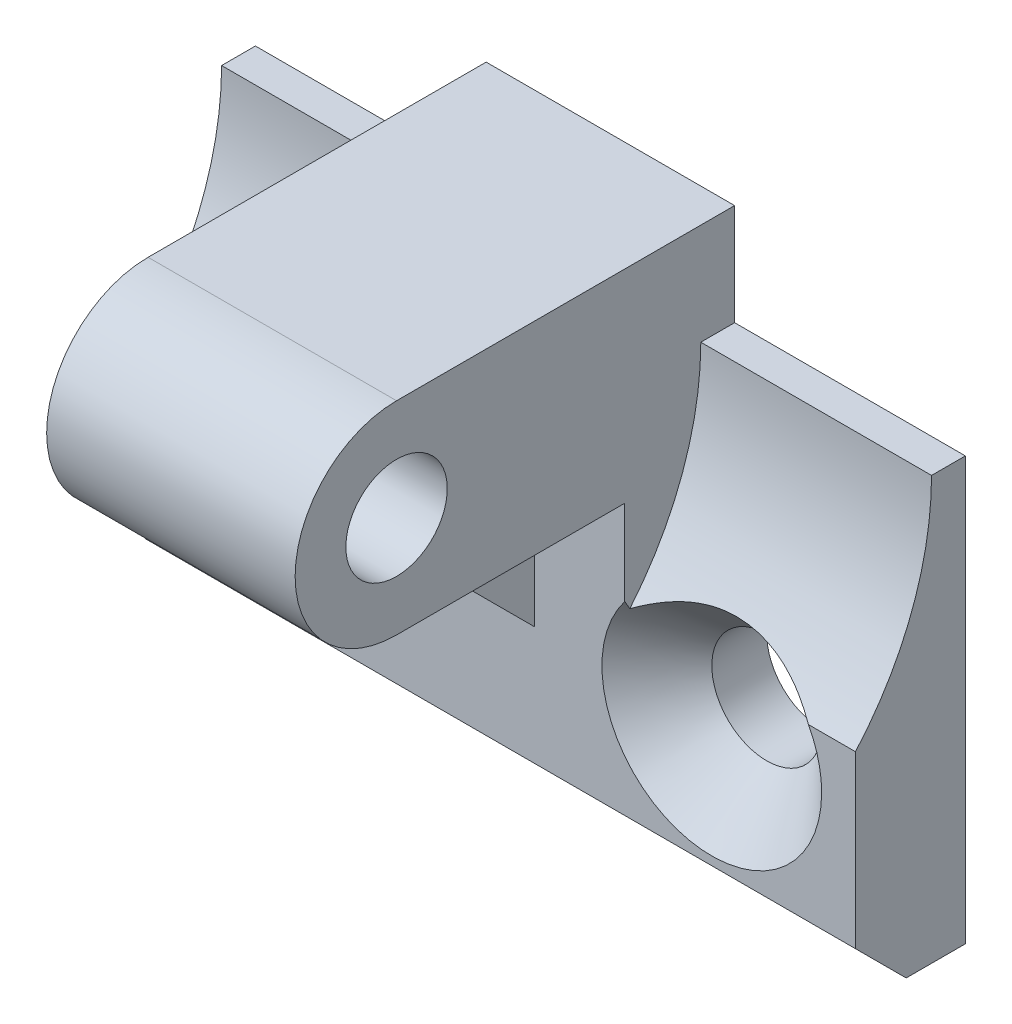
ISO-10303-21;
HEADER;
FILE_DESCRIPTION(('STEP AP214'),'2;1');
FILE_NAME('part.step','',(''),(''),'','','');
FILE_SCHEMA(('AUTOMOTIVE_DESIGN { 1 0 10303 214 1 1 1 1 }'));
ENDSEC;
DATA;
#1=APPLICATION_CONTEXT('core data for automotive mechanical design processes');
#2=APPLICATION_PROTOCOL_DEFINITION('international standard','automotive_design',2000,#1);
#3=PRODUCT_CONTEXT('',#1,'mechanical');
#4=PRODUCT('Part','Part','',(#3));
#5=PRODUCT_RELATED_PRODUCT_CATEGORY('part','',(#4));
#6=PRODUCT_DEFINITION_FORMATION('','',#4);
#7=PRODUCT_DEFINITION_CONTEXT('part definition',#1,'design');
#8=PRODUCT_DEFINITION('design','',#6,#7);
#9=PRODUCT_DEFINITION_SHAPE('','',#8);
#10=(LENGTH_UNIT() NAMED_UNIT(*) SI_UNIT(.MILLI.,.METRE.));
#11=(NAMED_UNIT(*) PLANE_ANGLE_UNIT() SI_UNIT($,.RADIAN.));
#12=(NAMED_UNIT(*) SI_UNIT($,.STERADIAN.) SOLID_ANGLE_UNIT());
#13=UNCERTAINTY_MEASURE_WITH_UNIT(LENGTH_MEASURE(1.E-05),#10,'distance_accuracy_value','');
#14=(GEOMETRIC_REPRESENTATION_CONTEXT(3) GLOBAL_UNCERTAINTY_ASSIGNED_CONTEXT((#13)) GLOBAL_UNIT_ASSIGNED_CONTEXT((#10,
#11,#12)) REPRESENTATION_CONTEXT('',''));
#15=CARTESIAN_POINT('',(0.,0.,0.));
#16=DIRECTION('',(0.,0.,1.));
#17=DIRECTION('',(1.,0.,0.));
#18=AXIS2_PLACEMENT_3D('',#15,#16,#17);
#19=CARTESIAN_POINT('',(-8.5,-7.,6.5));
#20=DIRECTION('',(0.,0.,-1.));
#21=DIRECTION('',(0.,-1.,0.));
#22=AXIS2_PLACEMENT_3D('',#19,#20,#21);
#23=PLANE('',#22);
#24=CARTESIAN_POINT('',(0.,0.,6.5));
#25=DIRECTION('',(0.,0.,1.));
#26=DIRECTION('',(1.,0.,0.));
#27=AXIS2_PLACEMENT_3D('',#24,#25,#26);
#28=CIRCLE('',#27,6.5);
#29=CARTESIAN_POINT('',(-5.7163298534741,3.09411910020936,6.5));
#30=VERTEX_POINT('',#29);
#31=CARTESIAN_POINT('',(5.15,3.96579121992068,6.5));
#32=VERTEX_POINT('',#31);
#33=EDGE_CURVE('E30',#30,#32,#28,.T.);
#34=ORIENTED_EDGE('',*,*,#33,.F.);
#35=DIRECTION('',(-1.,0.,0.));
#36=VECTOR('',#35,1.);
#37=CARTESIAN_POINT('',(5.15,3.09411910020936,6.5));
#38=LINE('',#37,#36);
#39=CARTESIAN_POINT('',(-8.5,3.09411910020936,6.5));
#40=VERTEX_POINT('',#39);
#41=EDGE_CURVE('E148',#30,#40,#38,.T.);
#42=ORIENTED_EDGE('',*,*,#41,.T.);
#43=DIRECTION('',(0.,1.,0.));
#44=VECTOR('',#43,1.);
#45=CARTESIAN_POINT('',(-8.5,-7.,6.5));
#46=LINE('',#45,#44);
#47=CARTESIAN_POINT('',(-8.5,-7.,6.5));
#48=VERTEX_POINT('',#47);
#49=EDGE_CURVE('E229',#48,#40,#46,.T.);
#50=ORIENTED_EDGE('',*,*,#49,.F.);
#51=DIRECTION('',(1.,0.,0.));
#52=VECTOR('',#51,1.);
#53=CARTESIAN_POINT('',(-8.5,-7.,6.5));
#54=LINE('',#53,#52);
#55=CARTESIAN_POINT('',(33.5,-7.,6.5));
#56=VERTEX_POINT('',#55);
#57=EDGE_CURVE('E251',#48,#56,#54,.T.);
#58=ORIENTED_EDGE('',*,*,#57,.T.);
#59=DIRECTION('',(0.,1.,0.));
#60=VECTOR('',#59,1.);
#61=CARTESIAN_POINT('',(33.5,-7.,6.5));
#62=LINE('',#61,#60);
#63=CARTESIAN_POINT('',(33.5,3.09411910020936,6.5));
#64=VERTEX_POINT('',#63);
#65=EDGE_CURVE('E219',#56,#64,#62,.T.);
#66=ORIENTED_EDGE('',*,*,#65,.T.);
#67=DIRECTION('',(1.,0.,0.));
#68=VECTOR('',#67,1.);
#69=CARTESIAN_POINT('',(19.85,3.09411910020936,6.5));
#70=LINE('',#69,#68);
#71=CARTESIAN_POINT('',(30.7163298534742,3.09411910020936,6.5));
#72=VERTEX_POINT('',#71);
#73=EDGE_CURVE('E553',#64,#72,#70,.F.);
#74=ORIENTED_EDGE('',*,*,#73,.T.);
#75=CARTESIAN_POINT('',(25.,0.,6.5));
#76=DIRECTION('',(0.,0.,1.));
#77=DIRECTION('',(1.,0.,0.));
#78=AXIS2_PLACEMENT_3D('',#75,#76,#77);
#79=CIRCLE('',#78,6.5);
#80=CARTESIAN_POINT('',(19.85,3.96579121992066,6.5));
#81=VERTEX_POINT('',#80);
#82=EDGE_CURVE('E321',#81,#72,#79,.T.);
#83=ORIENTED_EDGE('',*,*,#82,.F.);
#84=DIRECTION('',(0.,1.,0.));
#85=VECTOR('',#84,1.);
#86=CARTESIAN_POINT('',(19.85,15.,6.5));
#87=LINE('',#86,#85);
#88=CARTESIAN_POINT('',(19.85,9.,6.5));
#89=VERTEX_POINT('',#88);
#90=EDGE_CURVE('E256',#81,#89,#87,.T.);
#91=ORIENTED_EDGE('',*,*,#90,.T.);
#92=DIRECTION('',(1.,0.,0.));
#93=VECTOR('',#92,1.);
#94=CARTESIAN_POINT('',(14.5,9.,6.5));
#95=LINE('',#94,#93);
#96=CARTESIAN_POINT('',(14.5,9.,6.5));
#97=VERTEX_POINT('',#96);
#98=EDGE_CURVE('E550',#97,#89,#95,.T.);
#99=ORIENTED_EDGE('',*,*,#98,.F.);
#100=DIRECTION('',(0.,1.,0.));
#101=VECTOR('',#100,1.);
#102=CARTESIAN_POINT('',(14.5,0.,6.5));
#103=LINE('',#102,#101);
#104=CARTESIAN_POINT('',(14.5,0.,6.5));
#105=VERTEX_POINT('',#104);
#106=EDGE_CURVE('E542',#105,#97,#103,.T.);
#107=ORIENTED_EDGE('',*,*,#106,.F.);
#108=DIRECTION('',(1.,0.,0.));
#109=VECTOR('',#108,1.);
#110=CARTESIAN_POINT('',(-8.5,0.,6.5));
#111=LINE('',#110,#109);
#112=CARTESIAN_POINT('',(10.5,0.,6.5));
#113=VERTEX_POINT('',#112);
#114=EDGE_CURVE('E248',#113,#105,#111,.T.);
#115=ORIENTED_EDGE('',*,*,#114,.F.);
#116=DIRECTION('',(0.,1.,0.));
#117=VECTOR('',#116,1.);
#118=CARTESIAN_POINT('',(10.5,0.,6.5));
#119=LINE('',#118,#117);
#120=CARTESIAN_POINT('',(10.5,9.,6.5));
#121=VERTEX_POINT('',#120);
#122=EDGE_CURVE('E163',#113,#121,#119,.T.);
#123=ORIENTED_EDGE('',*,*,#122,.T.);
#124=DIRECTION('',(-1.,0.,0.));
#125=VECTOR('',#124,1.);
#126=CARTESIAN_POINT('',(10.5,9.,6.5));
#127=LINE('',#126,#125);
#128=CARTESIAN_POINT('',(5.15,9.,6.5));
#129=VERTEX_POINT('',#128);
#130=EDGE_CURVE('E158',#121,#129,#127,.T.);
#131=ORIENTED_EDGE('',*,*,#130,.T.);
#132=DIRECTION('',(0.,1.,0.));
#133=VECTOR('',#132,1.);
#134=CARTESIAN_POINT('',(5.15,15.,6.5));
#135=LINE('',#134,#133);
#136=EDGE_CURVE('E151',#32,#129,#135,.T.);
#137=ORIENTED_EDGE('',*,*,#136,.F.);
#138=EDGE_LOOP('',(#34,#42,#50,#58,#66,#74,#83,#91,#99,#107,#115,#123,#131,#137));
#139=FACE_BOUND('',#138,.T.);
#140=ADVANCED_FACE('F14',(#139),#23,.F.);
#141=CARTESIAN_POINT('',(-8.5,21.,0.));
#142=DIRECTION('',(0.,0.,1.));
#143=DIRECTION('',(0.,1.,0.));
#144=AXIS2_PLACEMENT_3D('',#141,#142,#143);
#145=PLANE('',#144);
#146=CARTESIAN_POINT('',(25.,0.,0.));
#147=DIRECTION('',(0.,0.,1.));
#148=DIRECTION('',(0.,1.,0.));
#149=AXIS2_PLACEMENT_3D('',#146,#147,#148);
#150=CIRCLE('',#149,3.25);
#151=CARTESIAN_POINT('',(25.,3.25,0.));
#152=VERTEX_POINT('',#151);
#153=EDGE_CURVE('E265',#152,#152,#150,.F.);
#154=ORIENTED_EDGE('',*,*,#153,.F.);
#155=EDGE_LOOP('',(#154));
#156=FACE_BOUND('',#155,.T.);
#157=DIRECTION('',(1.,0.,0.));
#158=VECTOR('',#157,1.);
#159=CARTESIAN_POINT('',(19.85,15.,0.));
#160=LINE('',#159,#158);
#161=CARTESIAN_POINT('',(19.85,15.,0.));
#162=VERTEX_POINT('',#161);
#163=CARTESIAN_POINT('',(33.5,15.,0.));
#164=VERTEX_POINT('',#163);
#165=EDGE_CURVE('E188',#162,#164,#160,.T.);
#166=ORIENTED_EDGE('',*,*,#165,.T.);
#167=DIRECTION('',(0.,-1.,0.));
#168=VECTOR('',#167,1.);
#169=CARTESIAN_POINT('',(33.5,21.,0.));
#170=LINE('',#169,#168);
#171=CARTESIAN_POINT('',(33.5,-10.,0.));
#172=VERTEX_POINT('',#171);
#173=EDGE_CURVE('E221',#164,#172,#170,.T.);
#174=ORIENTED_EDGE('',*,*,#173,.T.);
#175=DIRECTION('',(1.,0.,0.));
#176=VECTOR('',#175,1.);
#177=CARTESIAN_POINT('',(-8.5,-10.,0.));
#178=LINE('',#177,#176);
#179=CARTESIAN_POINT('',(-8.5,-10.,0.));
#180=VERTEX_POINT('',#179);
#181=EDGE_CURVE('E233',#180,#172,#178,.T.);
#182=ORIENTED_EDGE('',*,*,#181,.F.);
#183=DIRECTION('',(0.,-1.,0.));
#184=VECTOR('',#183,1.);
#185=CARTESIAN_POINT('',(-8.5,21.,0.));
#186=LINE('',#185,#184);
#187=CARTESIAN_POINT('',(-8.5,15.,0.));
#188=VERTEX_POINT('',#187);
#189=EDGE_CURVE('E231',#188,#180,#186,.T.);
#190=ORIENTED_EDGE('',*,*,#189,.F.);
#191=DIRECTION('',(-1.,0.,0.));
#192=VECTOR('',#191,1.);
#193=CARTESIAN_POINT('',(5.15,15.,0.));
#194=LINE('',#193,#192);
#195=CARTESIAN_POINT('',(5.15,15.,0.));
#196=VERTEX_POINT('',#195);
#197=EDGE_CURVE('E209',#196,#188,#194,.T.);
#198=ORIENTED_EDGE('',*,*,#197,.F.);
#199=DIRECTION('',(0.,-1.,0.));
#200=VECTOR('',#199,1.);
#201=CARTESIAN_POINT('',(5.15,21.,0.));
#202=LINE('',#201,#200);
#203=CARTESIAN_POINT('',(5.15,21.,0.));
#204=VERTEX_POINT('',#203);
#205=EDGE_CURVE('E202',#204,#196,#202,.T.);
#206=ORIENTED_EDGE('',*,*,#205,.F.);
#207=DIRECTION('',(1.,0.,0.));
#208=VECTOR('',#207,1.);
#209=CARTESIAN_POINT('',(-8.5,21.,0.));
#210=LINE('',#209,#208);
#211=CARTESIAN_POINT('',(19.85,21.,0.));
#212=VERTEX_POINT('',#211);
#213=EDGE_CURVE('E236',#204,#212,#210,.T.);
#214=ORIENTED_EDGE('',*,*,#213,.T.);
#215=DIRECTION('',(0.,-1.,0.));
#216=VECTOR('',#215,1.);
#217=CARTESIAN_POINT('',(19.85,21.,0.));
#218=LINE('',#217,#216);
#219=EDGE_CURVE('E178',#212,#162,#218,.T.);
#220=ORIENTED_EDGE('',*,*,#219,.T.);
#221=EDGE_LOOP('',(#166,#174,#182,#190,#198,#206,#214,#220));
#222=FACE_BOUND('',#221,.T.);
#223=CARTESIAN_POINT('',(0.,0.,0.));
#224=DIRECTION('',(0.,0.,1.));
#225=DIRECTION('',(0.,1.,0.));
#226=AXIS2_PLACEMENT_3D('',#223,#224,#225);
#227=CIRCLE('',#226,3.25);
#228=CARTESIAN_POINT('',(0.,3.25,0.));
#229=VERTEX_POINT('',#228);
#230=EDGE_CURVE('E18',#229,#229,#227,.F.);
#231=ORIENTED_EDGE('',*,*,#230,.F.);
#232=EDGE_LOOP('',(#231));
#233=FACE_BOUND('',#232,.T.);
#234=ADVANCED_FACE('F325',(#156,#222,#233),#145,.F.);
#235=CARTESIAN_POINT('',(5.15,15.,20.));
#236=DIRECTION('',(-1.,0.,0.));
#237=DIRECTION('',(0.,1.,0.));
#238=AXIS2_PLACEMENT_3D('',#235,#236,#237);
#239=CYLINDRICAL_SURFACE('',#238,18.);
#240=CARTESIAN_POINT('',(5.1502,3.44665389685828,6.1970947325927));
#241=CARTESIAN_POINT('',(5.03097353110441,3.51777116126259,6.13756417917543));
#242=CARTESIAN_POINT('',(4.91015867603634,3.58778049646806,6.07990387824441));
#243=CARTESIAN_POINT('',(4.66514255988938,3.72504671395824,5.96849168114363));
#244=CARTESIAN_POINT('',(4.54094002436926,3.7923025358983,5.91474128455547));
#245=CARTESIAN_POINT('',(4.16218516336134,3.98951678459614,5.75930817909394));
#246=CARTESIAN_POINT('',(3.90232528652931,4.11441164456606,5.66386680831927));
#247=CARTESIAN_POINT('',(3.36648035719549,4.3464540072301,5.49058425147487));
#248=CARTESIAN_POINT('',(3.09038662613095,4.45345757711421,5.4128841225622));
#249=CARTESIAN_POINT('',(2.52556654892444,4.643122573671,5.27761164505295));
#250=CARTESIAN_POINT('',(2.23686344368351,4.72582677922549,5.22000389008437));
#251=CARTESIAN_POINT('',(1.75028461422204,4.83901207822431,5.14209759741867));
#252=CARTESIAN_POINT('',(1.55523637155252,4.87767497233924,5.11577981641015));
#253=CARTESIAN_POINT('',(1.16188178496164,4.94160789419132,5.07250007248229));
#254=CARTESIAN_POINT('',(0.963575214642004,4.96687698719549,5.05553876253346));
#255=CARTESIAN_POINT('',(0.566297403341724,5.00319093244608,5.03122301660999));
#256=CARTESIAN_POINT('',(0.367337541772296,5.01432136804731,5.02381077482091));
#257=CARTESIAN_POINT('',(-0.0309901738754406,5.0223294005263,5.01847423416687));
#258=CARTESIAN_POINT('',(-0.230358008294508,5.01920766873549,5.02054948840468));
#259=CARTESIAN_POINT('',(-0.62791601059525,4.99880655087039,5.03416299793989));
#260=CARTESIAN_POINT('',(-0.826106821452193,4.98153578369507,5.04569549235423));
#261=CARTESIAN_POINT('',(-1.22004437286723,4.93333026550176,5.07810337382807));
#262=CARTESIAN_POINT('',(-1.41579098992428,4.90239482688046,5.09897923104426));
#263=CARTESIAN_POINT('',(-1.8048426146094,4.82745155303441,5.1500397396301));
#264=CARTESIAN_POINT('',(-1.99812389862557,4.78336111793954,5.18028325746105));
#265=CARTESIAN_POINT('',(-2.37989730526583,4.68333538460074,5.24974130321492));
#266=CARTESIAN_POINT('',(-2.56838974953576,4.62740088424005,5.28895522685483));
#267=CARTESIAN_POINT('',(-3.0280125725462,4.47596339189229,5.39668181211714));
#268=CARTESIAN_POINT('',(-3.29593594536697,4.37427595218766,5.47026937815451));
#269=CARTESIAN_POINT('',(-3.81877841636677,4.15261287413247,5.63499932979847));
#270=CARTESIAN_POINT('',(-4.07367855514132,4.03261153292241,5.72616643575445));
#271=CARTESIAN_POINT('',(-4.56715960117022,3.78066854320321,5.92335802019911));
#272=CARTESIAN_POINT('',(-4.80589879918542,3.64888624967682,6.0291924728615));
#273=CARTESIAN_POINT('',(-5.1544578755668,3.44477329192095,6.19838625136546));
#274=CARTESIAN_POINT('',(-5.26888719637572,3.37577127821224,6.25642916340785));
#275=CARTESIAN_POINT('',(-5.49486466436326,3.23603571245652,6.37584481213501));
#276=CARTESIAN_POINT('',(-5.60641362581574,3.16530266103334,6.43721659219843));
#277=CARTESIAN_POINT('',(-5.71663866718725,3.09391910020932,6.50017638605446));
#278=B_SPLINE_CURVE_WITH_KNOTS('',3,(#240,#241,#242,#243,#244,#245,#246,#247,#248,#249,#250,
#251,#252,#253,#254,#255,#256,#257,#258,#259,#260,#261,#262,#263,#264,#265,#266,#267,#268,#269,
#270,#271,#272,#273,#274,#275,#276,#277),.UNSPECIFIED.,.F.,.F.,(4,2,2,2,2,2,2,2,2,2,2,2,2,2,2,2,
2,2,4),(0.,0.453109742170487,0.906392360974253,1.8161579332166,2.73292283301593,
3.64806396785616,4.24917824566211,4.85033446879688,5.44783419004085,6.04530576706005,
6.64241366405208,7.23955161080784,7.8405208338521,8.44144958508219,9.32739150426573,
10.2145884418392,11.0912114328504,11.52820679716,11.9650772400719),.UNSPECIFIED.);
#279=CARTESIAN_POINT('',(5.15,3.44677319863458,6.19699487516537));
#280=VERTEX_POINT('',#279);
#281=EDGE_CURVE('E137',#280,#30,#278,.T.);
#282=ORIENTED_EDGE('',*,*,#281,.F.);
#283=CARTESIAN_POINT('',(5.15,15.,20.));
#284=DIRECTION('',(-1.,0.,0.));
#285=DIRECTION('',(0.,1.,0.));
#286=AXIS2_PLACEMENT_3D('',#283,#284,#285);
#287=CIRCLE('',#286,18.);
#288=CARTESIAN_POINT('',(5.15,15.,2.));
#289=VERTEX_POINT('',#288);
#290=EDGE_CURVE('E207',#289,#280,#287,.T.);
#291=ORIENTED_EDGE('',*,*,#290,.F.);
#292=DIRECTION('',(-1.,0.,0.));
#293=VECTOR('',#292,1.);
#294=CARTESIAN_POINT('',(5.15,15.,2.));
#295=LINE('',#294,#293);
#296=CARTESIAN_POINT('',(-8.5,15.,2.));
#297=VERTEX_POINT('',#296);
#298=EDGE_CURVE('E211',#289,#297,#295,.T.);
#299=ORIENTED_EDGE('',*,*,#298,.T.);
#300=CARTESIAN_POINT('',(-8.5,15.,20.));
#301=DIRECTION('',(-1.,0.,0.));
#302=DIRECTION('',(0.,1.,0.));
#303=AXIS2_PLACEMENT_3D('',#300,#301,#302);
#304=CIRCLE('',#303,18.);
#305=EDGE_CURVE('E156',#297,#40,#304,.T.);
#306=ORIENTED_EDGE('',*,*,#305,.T.);
#307=ORIENTED_EDGE('',*,*,#41,.F.);
#308=EDGE_LOOP('',(#282,#291,#299,#306,#307));
#309=FACE_BOUND('',#308,.T.);
#310=ADVANCED_FACE('F154',(#309),#239,.F.);
#311=CARTESIAN_POINT('',(5.15,15.,20.));
#312=DIRECTION('',(-1.,0.,0.));
#313=DIRECTION('',(0.,1.,0.));
#314=AXIS2_PLACEMENT_3D('',#311,#312,#313);
#315=PLANE('',#314);
#316=CARTESIAN_POINT('',(5.15,15.,20.));
#317=DIRECTION('',(-1.,0.,0.));
#318=DIRECTION('',(0.,1.,0.));
#319=AXIS2_PLACEMENT_3D('',#316,#317,#318);
#320=CIRCLE('',#319,3.);
#321=CARTESIAN_POINT('',(5.15,18.,20.));
#322=VERTEX_POINT('',#321);
#323=EDGE_CURVE('E536',#322,#322,#320,.T.);
#324=ORIENTED_EDGE('',*,*,#323,.F.);
#325=EDGE_LOOP('',(#324));
#326=FACE_BOUND('',#325,.T.);
#327=ORIENTED_EDGE('',*,*,#290,.T.);
#328=CARTESIAN_POINT('',(5.15,1.10068167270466,5.26630801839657));
#329=CARTESIAN_POINT('',(5.15,1.31010374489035,5.31005726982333));
#330=CARTESIAN_POINT('',(5.15,1.51673375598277,5.36522359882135));
#331=CARTESIAN_POINT('',(5.15,1.92340977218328,5.49408516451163));
#332=CARTESIAN_POINT('',(5.15,2.12347604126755,5.56771578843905));
#333=CARTESIAN_POINT('',(5.15,2.51564301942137,5.72880686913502));
#334=CARTESIAN_POINT('',(5.15,2.70780048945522,5.81613239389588));
#335=CARTESIAN_POINT('',(5.15,3.08679439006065,6.001960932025));
#336=CARTESIAN_POINT('',(5.15,3.27362589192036,6.10047390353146));
#337=CARTESIAN_POINT('',(5.15,3.72153954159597,6.35014635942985));
#338=CARTESIAN_POINT('',(5.15,3.98011729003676,6.50577067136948));
#339=CARTESIAN_POINT('',(5.15,4.48951108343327,6.82931855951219));
#340=CARTESIAN_POINT('',(5.15,4.7403234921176,6.99724777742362));
#341=CARTESIAN_POINT('',(5.15,5.23626435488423,7.34228865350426));
#342=CARTESIAN_POINT('',(5.15,5.48138032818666,7.51941814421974));
#343=CARTESIAN_POINT('',(5.15,5.96667361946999,7.8801902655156));
#344=CARTESIAN_POINT('',(5.15,6.20685184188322,8.06383168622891));
#345=CARTESIAN_POINT('',(5.15,6.69055920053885,8.44171864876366));
#346=CARTESIAN_POINT('',(5.15,6.93396866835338,8.63611686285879));
#347=CARTESIAN_POINT('',(5.15,7.41751690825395,9.02896559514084));
#348=CARTESIAN_POINT('',(5.15,7.65765542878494,9.2274164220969));
#349=CARTESIAN_POINT('',(5.15,8.13390038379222,9.6263162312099));
#350=CARTESIAN_POINT('',(5.15,8.37002211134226,9.82674699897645));
#351=CARTESIAN_POINT('',(5.15,8.84006118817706,10.2300963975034));
#352=CARTESIAN_POINT('',(5.15,9.0739789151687,10.4330145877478));
#353=CARTESIAN_POINT('',(5.15,9.30704316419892,10.6368958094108));
#354=B_SPLINE_CURVE_WITH_KNOTS('',3,(#328,#329,#330,#331,#332,#333,#334,#335,#336,#337,#338,
#339,#340,#341,#342,#343,#344,#345,#346,#347,#348,#349,#350,#351,#352,#353),.UNSPECIFIED.,.F.,
.F.,(4,2,2,2,2,2,2,2,2,2,2,2,4),(0.,0.640935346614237,1.27965840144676,1.91244359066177,
2.54579651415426,3.45066097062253,4.35594292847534,5.26305028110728,6.16998997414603,
7.10446619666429,8.03901388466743,8.96815224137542,9.89712836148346),.UNSPECIFIED.);
#355=EDGE_CURVE('E9',#280,#32,#354,.T.);
#356=ORIENTED_EDGE('',*,*,#355,.T.);
#357=ORIENTED_EDGE('',*,*,#136,.T.);
#358=DIRECTION('',(0.,0.,1.));
#359=VECTOR('',#358,1.);
#360=CARTESIAN_POINT('',(5.15,9.,15.5));
#361=LINE('',#360,#359);
#362=CARTESIAN_POINT('',(5.15,9.,20.));
#363=VERTEX_POINT('',#362);
#364=EDGE_CURVE('E195',#129,#363,#361,.T.);
#365=ORIENTED_EDGE('',*,*,#364,.T.);
#366=CARTESIAN_POINT('',(5.15,15.,20.));
#367=DIRECTION('',(-1.,0.,0.));
#368=DIRECTION('',(0.,1.,0.));
#369=AXIS2_PLACEMENT_3D('',#366,#367,#368);
#370=CIRCLE('',#369,6.);
#371=CARTESIAN_POINT('',(5.15,21.,20.));
#372=VERTEX_POINT('',#371);
#373=EDGE_CURVE('E197',#363,#372,#370,.T.);
#374=ORIENTED_EDGE('',*,*,#373,.T.);
#375=DIRECTION('',(0.,0.,1.));
#376=VECTOR('',#375,1.);
#377=CARTESIAN_POINT('',(5.15,21.,0.));
#378=LINE('',#377,#376);
#379=EDGE_CURVE('E199',#204,#372,#378,.T.);
#380=ORIENTED_EDGE('',*,*,#379,.F.);
#381=ORIENTED_EDGE('',*,*,#205,.T.);
#382=DIRECTION('',(0.,0.,1.));
#383=VECTOR('',#382,1.);
#384=CARTESIAN_POINT('',(5.15,15.,0.));
#385=LINE('',#384,#383);
#386=EDGE_CURVE('E204',#196,#289,#385,.T.);
#387=ORIENTED_EDGE('',*,*,#386,.T.);
#388=EDGE_LOOP('',(#327,#356,#357,#365,#374,#380,#381,#387));
#389=FACE_BOUND('',#388,.T.);
#390=ADVANCED_FACE('F295',(#326,#389),#315,.T.);
#391=CARTESIAN_POINT('',(19.85,15.,20.));
#392=DIRECTION('',(1.,0.,0.));
#393=DIRECTION('',(0.,-1.,0.));
#394=AXIS2_PLACEMENT_3D('',#391,#392,#393);
#395=CYLINDRICAL_SURFACE('',#394,18.);
#396=CARTESIAN_POINT('',(19.85,15.,20.));
#397=DIRECTION('',(-1.,0.,0.));
#398=DIRECTION('',(0.,1.,0.));
#399=AXIS2_PLACEMENT_3D('',#396,#397,#398);
#400=CIRCLE('',#399,18.);
#401=CARTESIAN_POINT('',(19.85,15.,2.));
#402=VERTEX_POINT('',#401);
#403=CARTESIAN_POINT('',(19.85,3.44677319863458,6.19699487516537));
#404=VERTEX_POINT('',#403);
#405=EDGE_CURVE('E172',#402,#404,#400,.T.);
#406=ORIENTED_EDGE('',*,*,#405,.T.);
#407=CARTESIAN_POINT('',(19.8498,3.44665389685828,6.1970947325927));
#408=CARTESIAN_POINT('',(19.9690264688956,3.51777116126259,6.13756417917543));
#409=CARTESIAN_POINT('',(20.0898413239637,3.58778049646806,6.07990387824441));
#410=CARTESIAN_POINT('',(20.3348574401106,3.72504671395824,5.96849168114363));
#411=CARTESIAN_POINT('',(20.4590599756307,3.7923025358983,5.91474128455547));
#412=CARTESIAN_POINT('',(20.8378148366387,3.98951678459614,5.75930817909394));
#413=CARTESIAN_POINT('',(21.0976747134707,4.11441164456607,5.66386680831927));
#414=CARTESIAN_POINT('',(21.6335196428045,4.34645400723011,5.49058425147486));
#415=CARTESIAN_POINT('',(21.9096133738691,4.45345757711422,5.41288412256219));
#416=CARTESIAN_POINT('',(22.4744334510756,4.64312257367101,5.27761164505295));
#417=CARTESIAN_POINT('',(22.7631365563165,4.72582677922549,5.22000389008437));
#418=CARTESIAN_POINT('',(23.249715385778,4.83901207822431,5.14209759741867));
#419=CARTESIAN_POINT('',(23.4447636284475,4.87767497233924,5.11577981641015));
#420=CARTESIAN_POINT('',(23.8381182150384,4.94160789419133,5.07250007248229));
#421=CARTESIAN_POINT('',(24.036424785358,4.96687698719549,5.05553876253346));
#422=CARTESIAN_POINT('',(24.4337025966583,5.00319093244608,5.03122301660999));
#423=CARTESIAN_POINT('',(24.6326624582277,5.01432136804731,5.02381077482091));
#424=CARTESIAN_POINT('',(25.0309901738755,5.0223294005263,5.01847423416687));
#425=CARTESIAN_POINT('',(25.2303580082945,5.01920766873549,5.02054948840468));
#426=CARTESIAN_POINT('',(25.6279160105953,4.99880655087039,5.03416299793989));
#427=CARTESIAN_POINT('',(25.8261068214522,4.98153578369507,5.04569549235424));
#428=CARTESIAN_POINT('',(26.2200443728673,4.93333026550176,5.07810337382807));
#429=CARTESIAN_POINT('',(26.4157909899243,4.90239482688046,5.09897923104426));
#430=CARTESIAN_POINT('',(26.8048426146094,4.8274515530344,5.15003973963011));
#431=CARTESIAN_POINT('',(26.9981238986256,4.78336111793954,5.18028325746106));
#432=CARTESIAN_POINT('',(27.3798973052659,4.68333538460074,5.24974130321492));
#433=CARTESIAN_POINT('',(27.5683897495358,4.62740088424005,5.28895522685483));
#434=CARTESIAN_POINT('',(28.0280125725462,4.4759633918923,5.39668181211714));
#435=CARTESIAN_POINT('',(28.295935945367,4.37427595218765,5.47026937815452));
#436=CARTESIAN_POINT('',(28.8187784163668,4.15261287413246,5.63499932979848));
#437=CARTESIAN_POINT('',(29.0736785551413,4.03261153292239,5.72616643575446));
#438=CARTESIAN_POINT('',(29.5671596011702,3.7806685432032,5.92335802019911));
#439=CARTESIAN_POINT('',(29.8058987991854,3.64888624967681,6.0291924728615));
#440=CARTESIAN_POINT('',(30.1544578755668,3.44477329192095,6.19838625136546));
#441=CARTESIAN_POINT('',(30.2688871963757,3.37577127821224,6.25642916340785));
#442=CARTESIAN_POINT('',(30.4948646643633,3.23603571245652,6.37584481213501));
#443=CARTESIAN_POINT('',(30.6064136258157,3.16530266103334,6.43721659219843));
#444=CARTESIAN_POINT('',(30.7166386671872,3.09391910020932,6.50017638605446));
#445=B_SPLINE_CURVE_WITH_KNOTS('',3,(#407,#408,#409,#410,#411,#412,#413,#414,#415,#416,#417,
#418,#419,#420,#421,#422,#423,#424,#425,#426,#427,#428,#429,#430,#431,#432,#433,#434,#435,#436,
#437,#438,#439,#440,#441,#442,#443,#444),.UNSPECIFIED.,.F.,.F.,(4,2,2,2,2,2,2,2,2,2,2,2,2,2,2,2,
2,2,4),(0.,0.453109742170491,0.906392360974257,1.81615793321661,2.73292283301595,
3.64806396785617,4.24917824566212,4.85033446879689,5.44783419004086,6.04530576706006,
6.6424136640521,7.23955161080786,7.84052083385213,8.44144958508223,9.32739150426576,
10.2145884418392,11.0912114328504,11.52820679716,11.9650772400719),.UNSPECIFIED.);
#446=EDGE_CURVE('E37',#404,#72,#445,.T.);
#447=ORIENTED_EDGE('',*,*,#446,.T.);
#448=ORIENTED_EDGE('',*,*,#73,.F.);
#449=CARTESIAN_POINT('',(33.5,15.,20.));
#450=DIRECTION('',(-1.,0.,0.));
#451=DIRECTION('',(0.,1.,0.));
#452=AXIS2_PLACEMENT_3D('',#449,#450,#451);
#453=CIRCLE('',#452,18.);
#454=CARTESIAN_POINT('',(33.5,15.,2.));
#455=VERTEX_POINT('',#454);
#456=EDGE_CURVE('E157',#455,#64,#453,.T.);
#457=ORIENTED_EDGE('',*,*,#456,.F.);
#458=DIRECTION('',(1.,0.,0.));
#459=VECTOR('',#458,1.);
#460=CARTESIAN_POINT('',(19.85,15.,2.));
#461=LINE('',#460,#459);
#462=EDGE_CURVE('E186',#402,#455,#461,.T.);
#463=ORIENTED_EDGE('',*,*,#462,.F.);
#464=EDGE_LOOP('',(#406,#447,#448,#457,#463));
#465=FACE_BOUND('',#464,.T.);
#466=ADVANCED_FACE('F291',(#465),#395,.F.);
#467=CARTESIAN_POINT('',(19.85,15.,20.));
#468=DIRECTION('',(1.,0.,0.));
#469=DIRECTION('',(0.,1.,0.));
#470=AXIS2_PLACEMENT_3D('',#467,#468,#469);
#471=PLANE('',#470);
#472=CARTESIAN_POINT('',(19.85,15.,20.));
#473=DIRECTION('',(1.,0.,0.));
#474=DIRECTION('',(0.,-1.,0.));
#475=AXIS2_PLACEMENT_3D('',#472,#473,#474);
#476=CIRCLE('',#475,3.);
#477=CARTESIAN_POINT('',(19.85,12.,20.));
#478=VERTEX_POINT('',#477);
#479=EDGE_CURVE('E289',#478,#478,#476,.T.);
#480=ORIENTED_EDGE('',*,*,#479,.F.);
#481=EDGE_LOOP('',(#480));
#482=FACE_BOUND('',#481,.T.);
#483=ORIENTED_EDGE('',*,*,#90,.F.);
#484=CARTESIAN_POINT('',(19.85,9.30704316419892,10.6368958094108));
#485=CARTESIAN_POINT('',(19.85,9.0739789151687,10.4330145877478));
#486=CARTESIAN_POINT('',(19.85,8.84006118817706,10.2300963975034));
#487=CARTESIAN_POINT('',(19.85,8.37002211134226,9.82674699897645));
#488=CARTESIAN_POINT('',(19.85,8.13390038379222,9.6263162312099));
#489=CARTESIAN_POINT('',(19.85,7.65765542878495,9.2274164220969));
#490=CARTESIAN_POINT('',(19.85,7.41751690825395,9.02896559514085));
#491=CARTESIAN_POINT('',(19.85,6.93396866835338,8.63611686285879));
#492=CARTESIAN_POINT('',(19.85,6.69055920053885,8.44171864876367));
#493=CARTESIAN_POINT('',(19.85,6.20685184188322,8.06383168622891));
#494=CARTESIAN_POINT('',(19.85,5.96667361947,7.8801902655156));
#495=CARTESIAN_POINT('',(19.85,5.48138032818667,7.51941814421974));
#496=CARTESIAN_POINT('',(19.85,5.23626435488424,7.34228865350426));
#497=CARTESIAN_POINT('',(19.85,4.7403234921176,6.99724777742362));
#498=CARTESIAN_POINT('',(19.85,4.48951108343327,6.82931855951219));
#499=CARTESIAN_POINT('',(19.85,3.98011729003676,6.50577067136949));
#500=CARTESIAN_POINT('',(19.85,3.72153954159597,6.35014635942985));
#501=CARTESIAN_POINT('',(19.85,3.27362589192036,6.10047390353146));
#502=CARTESIAN_POINT('',(19.85,3.08679439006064,6.001960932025));
#503=CARTESIAN_POINT('',(19.85,2.70780048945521,5.81613239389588));
#504=CARTESIAN_POINT('',(19.85,2.51564301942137,5.72880686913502));
#505=CARTESIAN_POINT('',(19.85,2.12347604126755,5.56771578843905));
#506=CARTESIAN_POINT('',(19.85,1.92340977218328,5.49408516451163));
#507=CARTESIAN_POINT('',(19.85,1.51673375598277,5.36522359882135));
#508=CARTESIAN_POINT('',(19.85,1.31010374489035,5.31005726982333));
#509=CARTESIAN_POINT('',(19.85,1.10068167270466,5.26630801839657));
#510=B_SPLINE_CURVE_WITH_KNOTS('',3,(#484,#485,#486,#487,#488,#489,#490,#491,#492,#493,#494,
#495,#496,#497,#498,#499,#500,#501,#502,#503,#504,#505,#506,#507,#508,#509),.UNSPECIFIED.,.F.,
.F.,(4,2,2,2,2,2,2,2,2,2,2,2,4),(0.,0.92897612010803,1.85811447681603,2.79266216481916,
3.72713838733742,4.63407808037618,5.54118543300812,6.44646739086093,7.35133184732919,
7.98468477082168,8.61746996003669,9.25619301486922,9.89712836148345),.UNSPECIFIED.);
#511=EDGE_CURVE('E23',#81,#404,#510,.T.);
#512=ORIENTED_EDGE('',*,*,#511,.T.);
#513=ORIENTED_EDGE('',*,*,#405,.F.);
#514=DIRECTION('',(0.,0.,1.));
#515=VECTOR('',#514,1.);
#516=CARTESIAN_POINT('',(19.85,15.,0.));
#517=LINE('',#516,#515);
#518=EDGE_CURVE('E175',#162,#402,#517,.T.);
#519=ORIENTED_EDGE('',*,*,#518,.F.);
#520=ORIENTED_EDGE('',*,*,#219,.F.);
#521=DIRECTION('',(0.,0.,1.));
#522=VECTOR('',#521,1.);
#523=CARTESIAN_POINT('',(19.85,21.,0.));
#524=LINE('',#523,#522);
#525=CARTESIAN_POINT('',(19.85,21.,20.));
#526=VERTEX_POINT('',#525);
#527=EDGE_CURVE('E181',#212,#526,#524,.T.);
#528=ORIENTED_EDGE('',*,*,#527,.T.);
#529=CARTESIAN_POINT('',(19.85,15.,20.));
#530=DIRECTION('',(-1.,0.,0.));
#531=DIRECTION('',(0.,1.,0.));
#532=AXIS2_PLACEMENT_3D('',#529,#530,#531);
#533=CIRCLE('',#532,6.);
#534=CARTESIAN_POINT('',(19.85,9.,20.));
#535=VERTEX_POINT('',#534);
#536=EDGE_CURVE('E183',#535,#526,#533,.T.);
#537=ORIENTED_EDGE('',*,*,#536,.F.);
#538=DIRECTION('',(0.,0.,1.));
#539=VECTOR('',#538,1.);
#540=CARTESIAN_POINT('',(19.85,9.,15.5));
#541=LINE('',#540,#539);
#542=EDGE_CURVE('E169',#89,#535,#541,.T.);
#543=ORIENTED_EDGE('',*,*,#542,.F.);
#544=EDGE_LOOP('',(#483,#512,#513,#519,#520,#528,#537,#543));
#545=FACE_BOUND('',#544,.T.);
#546=ADVANCED_FACE('F266',(#482,#545),#471,.T.);
#547=CARTESIAN_POINT('',(-8.5,0.,6.5));
#548=DIRECTION('',(0.,0.707106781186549,-0.707106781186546));
#549=DIRECTION('',(0.,-0.707106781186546,-0.707106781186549));
#550=AXIS2_PLACEMENT_3D('',#547,#548,#549);
#551=PLANE('',#550);
#552=DIRECTION('',(0.,0.707106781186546,0.707106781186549));
#553=VECTOR('',#552,1.);
#554=CARTESIAN_POINT('',(14.5,0.,6.5));
#555=LINE('',#554,#553);
#556=CARTESIAN_POINT('',(14.5,9.,15.5));
#557=VERTEX_POINT('',#556);
#558=EDGE_CURVE('E547',#105,#557,#555,.T.);
#559=ORIENTED_EDGE('',*,*,#558,.T.);
#560=DIRECTION('',(1.,0.,0.));
#561=VECTOR('',#560,1.);
#562=CARTESIAN_POINT('',(-8.5,9.,15.5));
#563=LINE('',#562,#561);
#564=CARTESIAN_POINT('',(10.5,9.,15.5));
#565=VERTEX_POINT('',#564);
#566=EDGE_CURVE('E245',#565,#557,#563,.T.);
#567=ORIENTED_EDGE('',*,*,#566,.F.);
#568=DIRECTION('',(0.,0.707106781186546,0.707106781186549));
#569=VECTOR('',#568,1.);
#570=CARTESIAN_POINT('',(10.5,0.,6.5));
#571=LINE('',#570,#569);
#572=EDGE_CURVE('E558',#113,#565,#571,.T.);
#573=ORIENTED_EDGE('',*,*,#572,.F.);
#574=ORIENTED_EDGE('',*,*,#114,.T.);
#575=EDGE_LOOP('',(#559,#567,#573,#574));
#576=FACE_BOUND('',#575,.T.);
#577=ADVANCED_FACE('F336',(#576),#551,.F.);
#578=CARTESIAN_POINT('',(-8.5,15.,20.));
#579=DIRECTION('',(-1.,0.,0.));
#580=DIRECTION('',(0.,1.,0.));
#581=AXIS2_PLACEMENT_3D('',#578,#579,#580);
#582=PLANE('',#581);
#583=ORIENTED_EDGE('',*,*,#49,.T.);
#584=ORIENTED_EDGE('',*,*,#305,.F.);
#585=DIRECTION('',(0.,0.,1.));
#586=VECTOR('',#585,1.);
#587=CARTESIAN_POINT('',(-8.5,15.,0.));
#588=LINE('',#587,#586);
#589=EDGE_CURVE('E191',#188,#297,#588,.T.);
#590=ORIENTED_EDGE('',*,*,#589,.F.);
#591=ORIENTED_EDGE('',*,*,#189,.T.);
#592=DIRECTION('',(0.,0.,1.));
#593=VECTOR('',#592,1.);
#594=CARTESIAN_POINT('',(-8.5,-10.,0.));
#595=LINE('',#594,#593);
#596=CARTESIAN_POINT('',(-8.5,-10.,3.5));
#597=VERTEX_POINT('',#596);
#598=EDGE_CURVE('E223',#180,#597,#595,.T.);
#599=ORIENTED_EDGE('',*,*,#598,.T.);
#600=DIRECTION('',(0.,0.707106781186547,0.707106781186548));
#601=VECTOR('',#600,1.);
#602=CARTESIAN_POINT('',(-8.5,-10.,3.5));
#603=LINE('',#602,#601);
#604=EDGE_CURVE('E226',#597,#48,#603,.T.);
#605=ORIENTED_EDGE('',*,*,#604,.T.);
#606=EDGE_LOOP('',(#583,#584,#590,#591,#599,#605));
#607=FACE_BOUND('',#606,.T.);
#608=ADVANCED_FACE('F332',(#607),#582,.T.);
#609=CARTESIAN_POINT('',(-8.5,9.,15.5));
#610=DIRECTION('',(0.,1.,0.));
#611=DIRECTION('',(0.,0.,-1.));
#612=AXIS2_PLACEMENT_3D('',#609,#610,#611);
#613=PLANE('',#612);
#614=ORIENTED_EDGE('',*,*,#542,.T.);
#615=DIRECTION('',(1.,0.,0.));
#616=VECTOR('',#615,1.);
#617=CARTESIAN_POINT('',(-8.5,9.,20.));
#618=LINE('',#617,#616);
#619=EDGE_CURVE('E242',#363,#535,#618,.T.);
#620=ORIENTED_EDGE('',*,*,#619,.F.);
#621=ORIENTED_EDGE('',*,*,#364,.F.);
#622=ORIENTED_EDGE('',*,*,#130,.F.);
#623=DIRECTION('',(0.,0.,1.));
#624=VECTOR('',#623,1.);
#625=CARTESIAN_POINT('',(10.5,9.,6.5));
#626=LINE('',#625,#624);
#627=EDGE_CURVE('E556',#121,#565,#626,.T.);
#628=ORIENTED_EDGE('',*,*,#627,.T.);
#629=ORIENTED_EDGE('',*,*,#566,.T.);
#630=DIRECTION('',(0.,0.,1.));
#631=VECTOR('',#630,1.);
#632=CARTESIAN_POINT('',(14.5,9.,6.5));
#633=LINE('',#632,#631);
#634=EDGE_CURVE('E540',#97,#557,#633,.T.);
#635=ORIENTED_EDGE('',*,*,#634,.F.);
#636=ORIENTED_EDGE('',*,*,#98,.T.);
#637=EDGE_LOOP('',(#614,#620,#621,#622,#628,#629,#635,#636));
#638=FACE_BOUND('',#637,.T.);
#639=ADVANCED_FACE('F335',(#638),#613,.F.);
#640=CARTESIAN_POINT('',(-8.5,15.,20.));
#641=DIRECTION('',(1.,0.,0.));
#642=DIRECTION('',(0.,-1.,0.));
#643=AXIS2_PLACEMENT_3D('',#640,#641,#642);
#644=CYLINDRICAL_SURFACE('',#643,6.);
#645=ORIENTED_EDGE('',*,*,#536,.T.);
#646=DIRECTION('',(1.,0.,0.));
#647=VECTOR('',#646,1.);
#648=CARTESIAN_POINT('',(-8.5,21.,20.));
#649=LINE('',#648,#647);
#650=EDGE_CURVE('E239',#372,#526,#649,.T.);
#651=ORIENTED_EDGE('',*,*,#650,.F.);
#652=ORIENTED_EDGE('',*,*,#373,.F.);
#653=ORIENTED_EDGE('',*,*,#619,.T.);
#654=EDGE_LOOP('',(#645,#651,#652,#653));
#655=FACE_BOUND('',#654,.T.);
#656=ADVANCED_FACE('F346',(#655),#644,.T.);
#657=CARTESIAN_POINT('',(-8.5,21.,0.));
#658=DIRECTION('',(0.,1.,0.));
#659=DIRECTION('',(0.,0.,-1.));
#660=AXIS2_PLACEMENT_3D('',#657,#658,#659);
#661=PLANE('',#660);
#662=ORIENTED_EDGE('',*,*,#650,.T.);
#663=ORIENTED_EDGE('',*,*,#527,.F.);
#664=ORIENTED_EDGE('',*,*,#213,.F.);
#665=ORIENTED_EDGE('',*,*,#379,.T.);
#666=EDGE_LOOP('',(#662,#663,#664,#665));
#667=FACE_BOUND('',#666,.T.);
#668=ADVANCED_FACE('F330',(#667),#661,.T.);
#669=CARTESIAN_POINT('',(33.5,15.,20.));
#670=DIRECTION('',(-1.,0.,0.));
#671=DIRECTION('',(0.,1.,0.));
#672=AXIS2_PLACEMENT_3D('',#669,#670,#671);
#673=PLANE('',#672);
#674=ORIENTED_EDGE('',*,*,#456,.T.);
#675=ORIENTED_EDGE('',*,*,#65,.F.);
#676=DIRECTION('',(0.,0.707106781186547,0.707106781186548));
#677=VECTOR('',#676,1.);
#678=CARTESIAN_POINT('',(33.5,-10.,3.5));
#679=LINE('',#678,#677);
#680=CARTESIAN_POINT('',(33.5,-10.,3.5));
#681=VERTEX_POINT('',#680);
#682=EDGE_CURVE('E216',#681,#56,#679,.T.);
#683=ORIENTED_EDGE('',*,*,#682,.F.);
#684=DIRECTION('',(0.,0.,1.));
#685=VECTOR('',#684,1.);
#686=CARTESIAN_POINT('',(33.5,-10.,0.));
#687=LINE('',#686,#685);
#688=EDGE_CURVE('E213',#172,#681,#687,.T.);
#689=ORIENTED_EDGE('',*,*,#688,.F.);
#690=ORIENTED_EDGE('',*,*,#173,.F.);
#691=DIRECTION('',(0.,0.,1.));
#692=VECTOR('',#691,1.);
#693=CARTESIAN_POINT('',(33.5,15.,0.));
#694=LINE('',#693,#692);
#695=EDGE_CURVE('E161',#164,#455,#694,.T.);
#696=ORIENTED_EDGE('',*,*,#695,.T.);
#697=EDGE_LOOP('',(#674,#675,#683,#689,#690,#696));
#698=FACE_BOUND('',#697,.T.);
#699=ADVANCED_FACE('F326',(#698),#673,.F.);
#700=CARTESIAN_POINT('',(-8.5,-10.,0.));
#701=DIRECTION('',(0.,1.,0.));
#702=DIRECTION('',(1.,0.,0.));
#703=AXIS2_PLACEMENT_3D('',#700,#701,#702);
#704=PLANE('',#703);
#705=DIRECTION('',(1.,0.,0.));
#706=VECTOR('',#705,1.);
#707=CARTESIAN_POINT('',(-8.5,-10.,3.5));
#708=LINE('',#707,#706);
#709=EDGE_CURVE('E253',#597,#681,#708,.T.);
#710=ORIENTED_EDGE('',*,*,#709,.F.);
#711=ORIENTED_EDGE('',*,*,#598,.F.);
#712=ORIENTED_EDGE('',*,*,#181,.T.);
#713=ORIENTED_EDGE('',*,*,#688,.T.);
#714=EDGE_LOOP('',(#710,#711,#712,#713));
#715=FACE_BOUND('',#714,.T.);
#716=ADVANCED_FACE('F329',(#715),#704,.F.);
#717=CARTESIAN_POINT('',(-8.5,-10.,3.5));
#718=DIRECTION('',(0.,0.707106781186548,-0.707106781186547));
#719=DIRECTION('',(0.,-0.707106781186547,-0.707106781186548));
#720=AXIS2_PLACEMENT_3D('',#717,#718,#719);
#721=PLANE('',#720);
#722=ORIENTED_EDGE('',*,*,#57,.F.);
#723=ORIENTED_EDGE('',*,*,#604,.F.);
#724=ORIENTED_EDGE('',*,*,#709,.T.);
#725=ORIENTED_EDGE('',*,*,#682,.T.);
#726=EDGE_LOOP('',(#722,#723,#724,#725));
#727=FACE_BOUND('',#726,.T.);
#728=ADVANCED_FACE('F16',(#727),#721,.F.);
#729=CARTESIAN_POINT('',(5.15,15.,0.));
#730=DIRECTION('',(0.,-1.,0.));
#731=DIRECTION('',(0.,0.,1.));
#732=AXIS2_PLACEMENT_3D('',#729,#730,#731);
#733=PLANE('',#732);
#734=ORIENTED_EDGE('',*,*,#197,.T.);
#735=ORIENTED_EDGE('',*,*,#589,.T.);
#736=ORIENTED_EDGE('',*,*,#298,.F.);
#737=ORIENTED_EDGE('',*,*,#386,.F.);
#738=EDGE_LOOP('',(#734,#735,#736,#737));
#739=FACE_BOUND('',#738,.T.);
#740=ADVANCED_FACE('F301',(#739),#733,.F.);
#741=CARTESIAN_POINT('',(19.85,15.,0.));
#742=DIRECTION('',(0.,1.,0.));
#743=DIRECTION('',(0.,0.,-1.));
#744=AXIS2_PLACEMENT_3D('',#741,#742,#743);
#745=PLANE('',#744);
#746=ORIENTED_EDGE('',*,*,#462,.T.);
#747=ORIENTED_EDGE('',*,*,#695,.F.);
#748=ORIENTED_EDGE('',*,*,#165,.F.);
#749=ORIENTED_EDGE('',*,*,#518,.T.);
#750=EDGE_LOOP('',(#746,#747,#748,#749));
#751=FACE_BOUND('',#750,.T.);
#752=ADVANCED_FACE('F297',(#751),#745,.T.);
#753=CARTESIAN_POINT('',(10.5,9.,6.5));
#754=DIRECTION('',(-1.,0.,0.));
#755=DIRECTION('',(0.,1.,0.));
#756=AXIS2_PLACEMENT_3D('',#753,#754,#755);
#757=PLANE('',#756);
#758=ORIENTED_EDGE('',*,*,#627,.F.);
#759=ORIENTED_EDGE('',*,*,#122,.F.);
#760=ORIENTED_EDGE('',*,*,#572,.T.);
#761=EDGE_LOOP('',(#758,#759,#760));
#762=FACE_BOUND('',#761,.T.);
#763=ADVANCED_FACE('F300',(#762),#757,.T.);
#764=CARTESIAN_POINT('',(14.5,9.,6.5));
#765=DIRECTION('',(1.,0.,0.));
#766=DIRECTION('',(0.,1.,0.));
#767=AXIS2_PLACEMENT_3D('',#764,#765,#766);
#768=PLANE('',#767);
#769=ORIENTED_EDGE('',*,*,#634,.T.);
#770=ORIENTED_EDGE('',*,*,#558,.F.);
#771=ORIENTED_EDGE('',*,*,#106,.T.);
#772=EDGE_LOOP('',(#769,#770,#771));
#773=FACE_BOUND('',#772,.T.);
#774=ADVANCED_FACE('F454',(#773),#768,.T.);
#775=CARTESIAN_POINT('',(-8.5,15.,20.));
#776=DIRECTION('',(1.,0.,0.));
#777=DIRECTION('',(0.,-1.,0.));
#778=AXIS2_PLACEMENT_3D('',#775,#776,#777);
#779=CYLINDRICAL_SURFACE('',#778,3.);
#780=ORIENTED_EDGE('',*,*,#323,.T.);
#781=EDGE_LOOP('',(#780));
#782=FACE_BOUND('',#781,.T.);
#783=ORIENTED_EDGE('',*,*,#479,.T.);
#784=EDGE_LOOP('',(#783));
#785=FACE_BOUND('',#784,.T.);
#786=ADVANCED_FACE('F462',(#782,#785),#779,.F.);
#787=CARTESIAN_POINT('',(25.,0.,6.5));
#788=DIRECTION('',(0.,0.,1.));
#789=DIRECTION('',(1.,0.,0.));
#790=AXIS2_PLACEMENT_3D('',#787,#788,#789);
#791=CYLINDRICAL_SURFACE('',#790,3.25);
#792=CARTESIAN_POINT('',(25.,0.,3.25));
#793=DIRECTION('',(0.,0.,1.));
#794=DIRECTION('',(1.,0.,0.));
#795=AXIS2_PLACEMENT_3D('',#792,#793,#794);
#796=CIRCLE('',#795,3.25);
#797=CARTESIAN_POINT('',(28.25,0.,3.25));
#798=VERTEX_POINT('',#797);
#799=EDGE_CURVE('E287',#798,#798,#796,.T.);
#800=ORIENTED_EDGE('',*,*,#799,.T.);
#801=EDGE_LOOP('',(#800));
#802=FACE_BOUND('',#801,.T.);
#803=ORIENTED_EDGE('',*,*,#153,.T.);
#804=EDGE_LOOP('',(#803));
#805=FACE_BOUND('',#804,.T.);
#806=ADVANCED_FACE('F276',(#802,#805),#791,.F.);
#807=CARTESIAN_POINT('',(25.,0.,3.25));
#808=DIRECTION('',(0.,0.,1.));
#809=DIRECTION('',(1.,0.,0.));
#810=AXIS2_PLACEMENT_3D('',#807,#808,#809);
#811=CONICAL_SURFACE('',#810,3.25,0.78539816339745);
#812=ORIENTED_EDGE('',*,*,#511,.F.);
#813=ORIENTED_EDGE('',*,*,#82,.T.);
#814=ORIENTED_EDGE('',*,*,#446,.F.);
#815=EDGE_LOOP('',(#812,#813,#814));
#816=FACE_BOUND('',#815,.T.);
#817=ORIENTED_EDGE('',*,*,#799,.F.);
#818=EDGE_LOOP('',(#817));
#819=FACE_BOUND('',#818,.T.);
#820=ADVANCED_FACE('F270',(#816,#819),#811,.F.);
#821=CARTESIAN_POINT('',(0.,0.,6.5));
#822=DIRECTION('',(0.,0.,1.));
#823=DIRECTION('',(1.,0.,0.));
#824=AXIS2_PLACEMENT_3D('',#821,#822,#823);
#825=CYLINDRICAL_SURFACE('',#824,3.25);
#826=CARTESIAN_POINT('',(0.,0.,3.25));
#827=DIRECTION('',(0.,0.,1.));
#828=DIRECTION('',(1.,0.,0.));
#829=AXIS2_PLACEMENT_3D('',#826,#827,#828);
#830=CIRCLE('',#829,3.25);
#831=CARTESIAN_POINT('',(3.25,0.,3.25));
#832=VERTEX_POINT('',#831);
#833=EDGE_CURVE('E143',#832,#832,#830,.T.);
#834=ORIENTED_EDGE('',*,*,#833,.T.);
#835=EDGE_LOOP('',(#834));
#836=FACE_BOUND('',#835,.T.);
#837=ORIENTED_EDGE('',*,*,#230,.T.);
#838=EDGE_LOOP('',(#837));
#839=FACE_BOUND('',#838,.T.);
#840=ADVANCED_FACE('F275',(#836,#839),#825,.F.);
#841=CARTESIAN_POINT('',(0.,0.,3.25));
#842=DIRECTION('',(0.,0.,1.));
#843=DIRECTION('',(1.,0.,0.));
#844=AXIS2_PLACEMENT_3D('',#841,#842,#843);
#845=CONICAL_SURFACE('',#844,3.25,0.78539816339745);
#846=ORIENTED_EDGE('',*,*,#833,.F.);
#847=EDGE_LOOP('',(#846));
#848=FACE_BOUND('',#847,.T.);
#849=ORIENTED_EDGE('',*,*,#281,.T.);
#850=ORIENTED_EDGE('',*,*,#33,.T.);
#851=ORIENTED_EDGE('',*,*,#355,.F.);
#852=EDGE_LOOP('',(#849,#850,#851));
#853=FACE_BOUND('',#852,.T.);
#854=ADVANCED_FACE('F138',(#848,#853),#845,.F.);
#855=CLOSED_SHELL('',(#140,#234,#310,#390,#466,#546,#577,#608,#639,#656,#668,#699,#716,#728,
#740,#752,#763,#774,#786,#806,#820,#840,#854));
#856=MANIFOLD_SOLID_BREP('B1',#855);
#857=ADVANCED_BREP_SHAPE_REPRESENTATION('',(#18,#856),#14);
#858=SHAPE_DEFINITION_REPRESENTATION(#9,#857);
ENDSEC;
END-ISO-10303-21;
